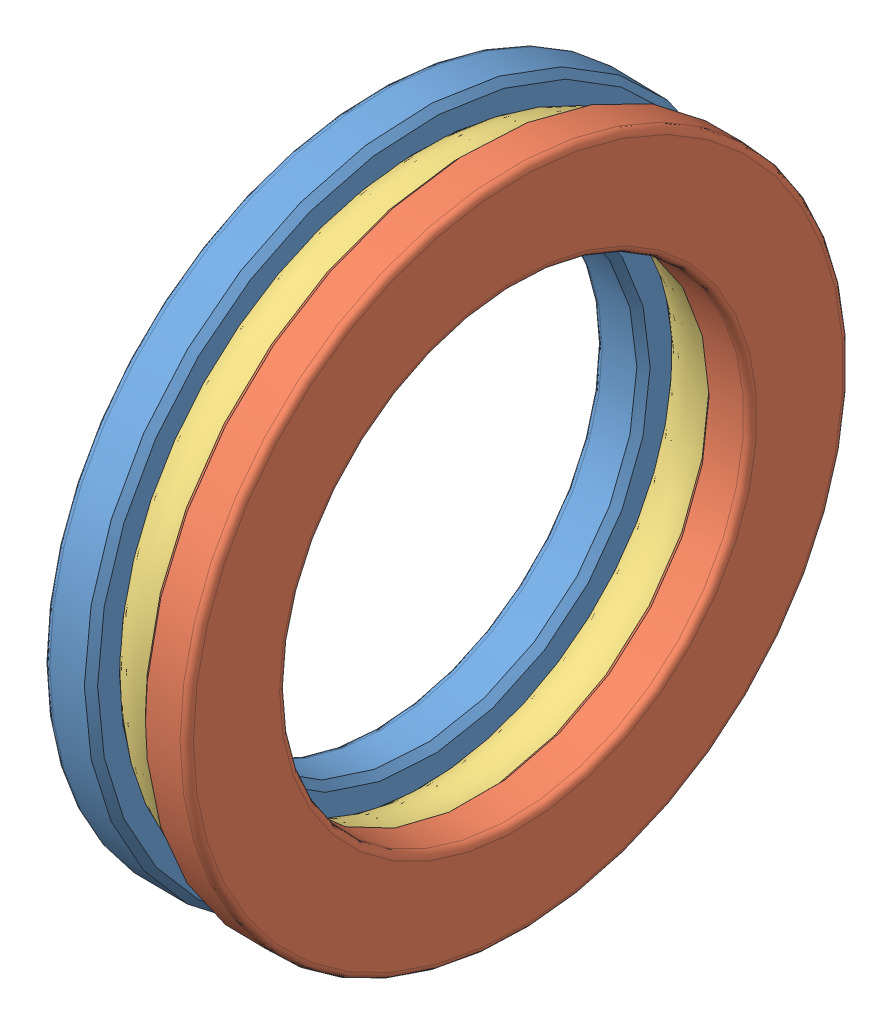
SolidWorks assembly butee_-_51108.sldasm, configuration Défaut (file format 4100). Lengths in mm.
Overall size (13 60 60).
3 component instances, 3 part files, 0 mates.
Components (placement in the parent):
- butee_-_51108_01-2: butee_-_51108_01.sldprt [Défaut] at origin size (4.33 60 60)
- butee_-_51108_02-2: butee_-_51108_02.sldprt [Défaut] at origin size (4.33 60 60)
- butee_-_51108_03-2: butee_-_51108_03.sldprt [Défaut] at origin size (6.5 56.5 56.5)
